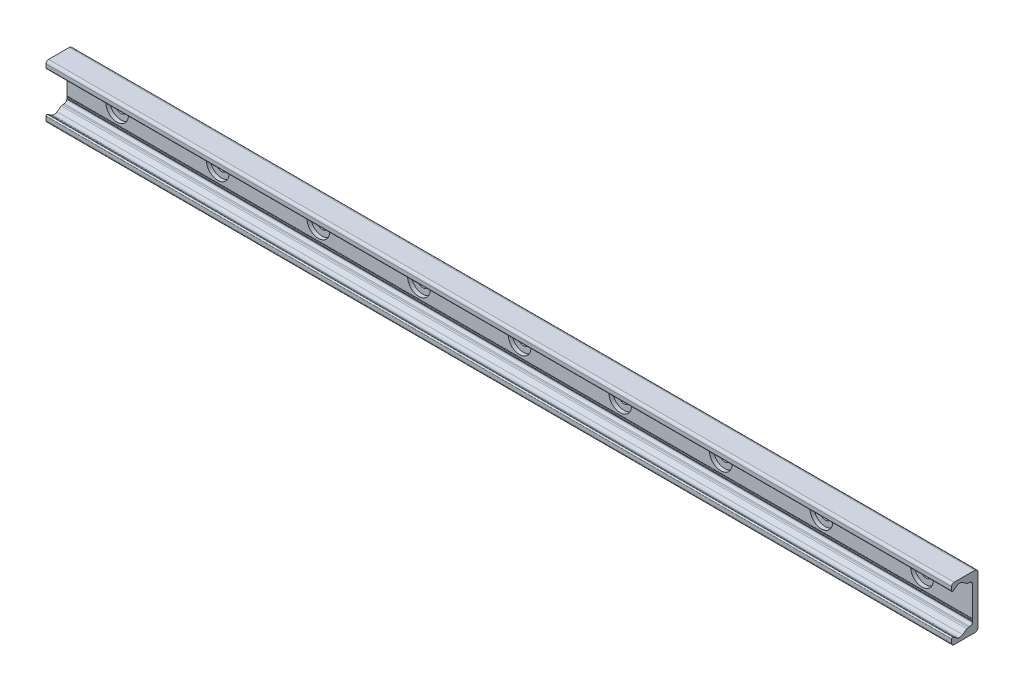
from build123d import *

# Parameters (mm, degrees)
BOSS_EXTRUDE1_DEPTH = 360
SKETCH2_R           = 9
SKETCH2_R_2         = 4.5
CUT_EXTRUDE1_DEPTH  = 3.1
SKETCH2_2_R         = 4.5
CUT_EXTRUDE2_DEPTH  = 362.018697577
LPATTERN1_COUNT     = 9
LPATTERN1_PITCH     = 80


with BuildPart() as part:
    # Sketch1 → Boss-Extrude1 (new, symmetric)
    with BuildSketch(Plane(origin=(0, 0, 0), x_dir=(0, 0, -1), z_dir=(1, 0, 0))):
        with BuildLine():
            Line((0, 0), (0, 19))
            ThreePointArc((0, 19), (-0.732233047, 20.767766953), (-2.5, 21.5))
            Line((-2.5, 21.5), (-19, 21.5))
            ThreePointArc((-19, 21.5), (-20.414213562, 20.914213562), (-21, 19.5))
            Line((-21, 19.5), (-21, 16.625057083))
            ThreePointArc((-21, 16.625057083), (-20.553251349, 15.888838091), (-19.693931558, 15.945160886))
            Line((-19.693931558, 15.945160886), (-16.794305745, 17.975500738))
            ThreePointArc((-16.794305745, 17.975500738), (-14.5, 18.69889256), (-12.205694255, 17.975500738))
            Line((-12.205694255, 17.975500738), (-8.829831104, 15.611695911))
            ThreePointArc((-8.829831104, 15.611695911), (-8.28408983, 15.342566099), (-7.682678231, 15.25))
            Line((-7.682678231, 15.25), (-6.5, 15.25))
            ThreePointArc((-6.5, 15.25), (-5.085786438, 14.664213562), (-4.5, 13.25))
            Line((-4.5, 13.25), (-4.5, -10.75))
            ThreePointArc((-4.5, -10.75), (-4.25, -11), (-4.5, -11.25))
            Line((-4.5, -11.25), (-4.5, -12.25))
            ThreePointArc((-4.5, -12.25), (-4.25, -12.5), (-4.5, -12.75))
            Line((-4.5, -12.75), (-4.5, -13.25))
            ThreePointArc((-4.5, -13.25), (-5.085786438, -14.664213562), (-6.5, -15.25))
            Line((-6.5, -15.25), (-7.682678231, -15.25))
            ThreePointArc((-7.682678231, -15.25), (-8.28408983, -15.342566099), (-8.829831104, -15.611695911))
            Line((-8.829831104, -15.611695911), (-12.205694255, -17.975500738))
            ThreePointArc((-12.205694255, -17.975500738), (-14.5, -18.69889256), (-16.794305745, -17.975500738))
            Line((-16.794305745, -17.975500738), (-19.693931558, -15.945160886))
            ThreePointArc((-19.693931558, -15.945160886), (-20.553251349, -15.888838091), (-21, -16.625057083))
            Line((-21, -16.625057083), (-21, -19.5))
            ThreePointArc((-21, -19.5), (-20.414213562, -20.914213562), (-19, -21.5))
            Line((-19, -21.5), (-2.5, -21.5))
            ThreePointArc((-2.5, -21.5), (-0.732233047, -20.767766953), (0, -19))
            Line((0, -19), (0, 0))
        make_face()
    extrude(amount=BOSS_EXTRUDE1_DEPTH, both=True)

    # Sketch2 → Cut-Extrude1 (cut)
    with BuildSketch(Plane.XY.offset(4.5)):
        with Locations((320, 0)):
            Circle(SKETCH2_R)
        with Locations((320, 0)):
            Circle(SKETCH2_R_2, mode=Mode.SUBTRACT)
    cut_extrude1 = extrude(amount=-CUT_EXTRUDE1_DEPTH, mode=Mode.SUBTRACT)

    # Sketch2_2 → Cut-Extrude2 (cut, through all)
    with BuildSketch(Plane.XY.offset(4.5)):
        with Locations((320, 0)):
            Circle(SKETCH2_2_R)
    cut_extrude2 = extrude(amount=-CUT_EXTRUDE2_DEPTH, mode=Mode.SUBTRACT)

    # LPattern1: Cut-Extrude1, Cut-Extrude2 ×9
    with Locations(*[(-i * LPATTERN1_PITCH, 0, 0) for i in range(1, LPATTERN1_COUNT)]):
        add(cut_extrude1, mode=Mode.SUBTRACT)
        add(cut_extrude2, mode=Mode.SUBTRACT)


solid = part.part
